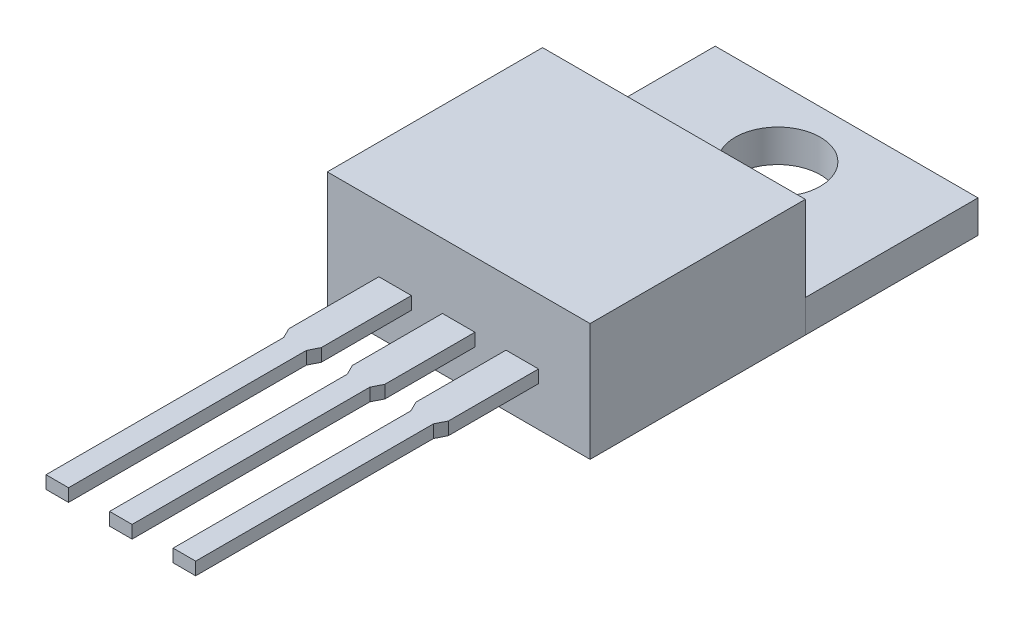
ISO-10303-21;
HEADER;
FILE_DESCRIPTION(('STEP AP214'),'2;1');
FILE_NAME('part.step','',(''),(''),'','','');
FILE_SCHEMA(('AUTOMOTIVE_DESIGN { 1 0 10303 214 1 1 1 1 }'));
ENDSEC;
DATA;
#1=APPLICATION_CONTEXT('core data for automotive mechanical design processes');
#2=APPLICATION_PROTOCOL_DEFINITION('international standard','automotive_design',2000,#1);
#3=PRODUCT_CONTEXT('',#1,'mechanical');
#4=PRODUCT('Part','Part','',(#3));
#5=PRODUCT_RELATED_PRODUCT_CATEGORY('part','',(#4));
#6=PRODUCT_DEFINITION_FORMATION('','',#4);
#7=PRODUCT_DEFINITION_CONTEXT('part definition',#1,'design');
#8=PRODUCT_DEFINITION('design','',#6,#7);
#9=PRODUCT_DEFINITION_SHAPE('','',#8);
#10=(LENGTH_UNIT() NAMED_UNIT(*) SI_UNIT(.MILLI.,.METRE.));
#11=(NAMED_UNIT(*) PLANE_ANGLE_UNIT() SI_UNIT($,.RADIAN.));
#12=(NAMED_UNIT(*) SI_UNIT($,.STERADIAN.) SOLID_ANGLE_UNIT());
#13=UNCERTAINTY_MEASURE_WITH_UNIT(LENGTH_MEASURE(1.E-05),#10,'distance_accuracy_value','');
#14=(GEOMETRIC_REPRESENTATION_CONTEXT(3) GLOBAL_UNCERTAINTY_ASSIGNED_CONTEXT((#13)) GLOBAL_UNIT_ASSIGNED_CONTEXT((#10,
#11,#12)) REPRESENTATION_CONTEXT('',''));
#15=CARTESIAN_POINT('',(0.,0.,0.));
#16=DIRECTION('',(0.,0.,1.));
#17=DIRECTION('',(1.,0.,0.));
#18=AXIS2_PLACEMENT_3D('',#15,#16,#17);
#19=CARTESIAN_POINT('',(-5.25,0.,-2.75));
#20=DIRECTION('',(0.,-1.,0.));
#21=DIRECTION('',(0.,0.,-1.));
#22=AXIS2_PLACEMENT_3D('',#19,#20,#21);
#23=PLANE('',#22);
#24=DIRECTION('',(0.,0.,1.));
#25=VECTOR('',#24,1.);
#26=CARTESIAN_POINT('',(-5.25,0.,12.75));
#27=LINE('',#26,#25);
#28=CARTESIAN_POINT('',(-5.25,0.,4.15));
#29=VERTEX_POINT('',#28);
#30=CARTESIAN_POINT('',(-5.25,0.,12.75));
#31=VERTEX_POINT('',#30);
#32=EDGE_CURVE('E540',#29,#31,#27,.T.);
#33=ORIENTED_EDGE('',*,*,#32,.F.);
#34=DIRECTION('',(1.,0.,0.));
#35=VECTOR('',#34,1.);
#36=CARTESIAN_POINT('',(-5.25,0.,4.15));
#37=LINE('',#36,#35);
#38=CARTESIAN_POINT('',(-4.25000000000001,0.,4.15));
#39=VERTEX_POINT('',#38);
#40=EDGE_CURVE('E12',#29,#39,#37,.T.);
#41=ORIENTED_EDGE('',*,*,#40,.T.);
#42=DIRECTION('',(0.,0.,1.));
#43=VECTOR('',#42,1.);
#44=CARTESIAN_POINT('',(-4.25000000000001,0.,-2.75));
#45=LINE('',#44,#43);
#46=CARTESIAN_POINT('',(-4.25,0.,11.75));
#47=VERTEX_POINT('',#46);
#48=EDGE_CURVE('E51',#39,#47,#45,.T.);
#49=ORIENTED_EDGE('',*,*,#48,.T.);
#50=DIRECTION('',(1.,0.,0.));
#51=VECTOR('',#50,1.);
#52=CARTESIAN_POINT('',(-5.25,0.,11.75));
#53=LINE('',#52,#51);
#54=CARTESIAN_POINT('',(4.25,0.,11.75));
#55=VERTEX_POINT('',#54);
#56=EDGE_CURVE('E592',#47,#55,#53,.T.);
#57=ORIENTED_EDGE('',*,*,#56,.T.);
#58=DIRECTION('',(0.,0.,-1.));
#59=VECTOR('',#58,1.);
#60=CARTESIAN_POINT('',(4.25000000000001,0.,-2.75));
#61=LINE('',#60,#59);
#62=CARTESIAN_POINT('',(4.25000000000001,0.,4.15));
#63=VERTEX_POINT('',#62);
#64=EDGE_CURVE('E589',#55,#63,#61,.T.);
#65=ORIENTED_EDGE('',*,*,#64,.T.);
#66=DIRECTION('',(1.,0.,0.));
#67=VECTOR('',#66,1.);
#68=CARTESIAN_POINT('',(-5.25,0.,4.15));
#69=LINE('',#68,#67);
#70=CARTESIAN_POINT('',(5.25,0.,4.15));
#71=VERTEX_POINT('',#70);
#72=EDGE_CURVE('E45',#63,#71,#69,.T.);
#73=ORIENTED_EDGE('',*,*,#72,.T.);
#74=DIRECTION('',(0.,0.,-1.));
#75=VECTOR('',#74,1.);
#76=CARTESIAN_POINT('',(5.25,0.,12.75));
#77=LINE('',#76,#75);
#78=CARTESIAN_POINT('',(5.25,0.,12.75));
#79=VERTEX_POINT('',#78);
#80=EDGE_CURVE('E561',#79,#71,#77,.T.);
#81=ORIENTED_EDGE('',*,*,#80,.F.);
#82=DIRECTION('',(1.,0.,0.));
#83=VECTOR('',#82,1.);
#84=CARTESIAN_POINT('',(-5.25,0.,12.75));
#85=LINE('',#84,#83);
#86=EDGE_CURVE('E557',#31,#79,#85,.T.);
#87=ORIENTED_EDGE('',*,*,#86,.F.);
#88=EDGE_LOOP('',(#33,#41,#49,#57,#65,#73,#81,#87));
#89=FACE_BOUND('',#88,.T.);
#90=ADVANCED_FACE('F41',(#89),#23,.T.);
#91=CARTESIAN_POINT('',(5.25,4.7,12.75));
#92=DIRECTION('',(-1.,0.,0.));
#93=DIRECTION('',(0.,0.,1.));
#94=AXIS2_PLACEMENT_3D('',#91,#92,#93);
#95=PLANE('',#94);
#96=DIRECTION('',(0.,-1.,0.));
#97=VECTOR('',#96,1.);
#98=CARTESIAN_POINT('',(5.25,4.7,4.15));
#99=LINE('',#98,#97);
#100=CARTESIAN_POINT('',(5.25000000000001,1.3,4.15));
#101=VERTEX_POINT('',#100);
#102=EDGE_CURVE('E585',#101,#71,#99,.T.);
#103=ORIENTED_EDGE('',*,*,#102,.F.);
#104=DIRECTION('',(0.,1.,0.));
#105=VECTOR('',#104,1.);
#106=CARTESIAN_POINT('',(5.25000000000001,-12.5642349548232,4.15));
#107=LINE('',#106,#105);
#108=CARTESIAN_POINT('',(5.25000000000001,4.7,4.15));
#109=VERTEX_POINT('',#108);
#110=EDGE_CURVE('E523',#101,#109,#107,.T.);
#111=ORIENTED_EDGE('',*,*,#110,.T.);
#112=DIRECTION('',(0.,0.,-1.));
#113=VECTOR('',#112,1.);
#114=CARTESIAN_POINT('',(5.25,4.7,12.75));
#115=LINE('',#114,#113);
#116=CARTESIAN_POINT('',(5.25,4.7,12.75));
#117=VERTEX_POINT('',#116);
#118=EDGE_CURVE('E548',#117,#109,#115,.T.);
#119=ORIENTED_EDGE('',*,*,#118,.F.);
#120=DIRECTION('',(0.,-1.,0.));
#121=VECTOR('',#120,1.);
#122=CARTESIAN_POINT('',(5.25,4.7,12.75));
#123=LINE('',#122,#121);
#124=EDGE_CURVE('E574',#117,#79,#123,.T.);
#125=ORIENTED_EDGE('',*,*,#124,.T.);
#126=ORIENTED_EDGE('',*,*,#80,.T.);
#127=EDGE_LOOP('',(#103,#111,#119,#125,#126));
#128=FACE_BOUND('',#127,.T.);
#129=ADVANCED_FACE('F662',(#128),#95,.F.);
#130=CARTESIAN_POINT('',(-5.25,4.7,12.75));
#131=DIRECTION('',(1.,0.,0.));
#132=DIRECTION('',(0.,0.,-1.));
#133=AXIS2_PLACEMENT_3D('',#130,#131,#132);
#134=PLANE('',#133);
#135=DIRECTION('',(0.,1.,0.));
#136=VECTOR('',#135,1.);
#137=CARTESIAN_POINT('',(-5.25,4.7,4.15));
#138=LINE('',#137,#136);
#139=CARTESIAN_POINT('',(-5.25,1.3,4.15));
#140=VERTEX_POINT('',#139);
#141=EDGE_CURVE('E582',#29,#140,#138,.T.);
#142=ORIENTED_EDGE('',*,*,#141,.F.);
#143=ORIENTED_EDGE('',*,*,#32,.T.);
#144=DIRECTION('',(0.,-1.,0.));
#145=VECTOR('',#144,1.);
#146=CARTESIAN_POINT('',(-5.25,4.7,12.75));
#147=LINE('',#146,#145);
#148=CARTESIAN_POINT('',(-5.25,4.7,12.75));
#149=VERTEX_POINT('',#148);
#150=EDGE_CURVE('E578',#149,#31,#147,.T.);
#151=ORIENTED_EDGE('',*,*,#150,.F.);
#152=DIRECTION('',(0.,0.,1.));
#153=VECTOR('',#152,1.);
#154=CARTESIAN_POINT('',(-5.25,4.7,12.75));
#155=LINE('',#154,#153);
#156=CARTESIAN_POINT('',(-5.25,4.7,4.15));
#157=VERTEX_POINT('',#156);
#158=EDGE_CURVE('E541',#157,#149,#155,.T.);
#159=ORIENTED_EDGE('',*,*,#158,.F.);
#160=DIRECTION('',(0.,1.,0.));
#161=VECTOR('',#160,1.);
#162=CARTESIAN_POINT('',(-5.25,-12.5642349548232,4.15));
#163=LINE('',#162,#161);
#164=EDGE_CURVE('E528',#140,#157,#163,.T.);
#165=ORIENTED_EDGE('',*,*,#164,.F.);
#166=EDGE_LOOP('',(#142,#143,#151,#159,#165));
#167=FACE_BOUND('',#166,.T.);
#168=ADVANCED_FACE('F653',(#167),#134,.F.);
#169=CARTESIAN_POINT('',(-5.25,4.7,12.75));
#170=DIRECTION('',(0.,0.,-1.));
#171=DIRECTION('',(-1.,0.,0.));
#172=AXIS2_PLACEMENT_3D('',#169,#170,#171);
#173=PLANE('',#172);
#174=DIRECTION('',(-1.,0.,0.));
#175=VECTOR('',#174,1.);
#176=CARTESIAN_POINT('',(-3.19,2.1,12.75));
#177=LINE('',#176,#175);
#178=CARTESIAN_POINT('',(-1.89,2.1,12.75));
#179=VERTEX_POINT('',#178);
#180=CARTESIAN_POINT('',(-3.19,2.1,12.75));
#181=VERTEX_POINT('',#180);
#182=EDGE_CURVE('E401',#179,#181,#177,.T.);
#183=ORIENTED_EDGE('',*,*,#182,.F.);
#184=DIRECTION('',(0.,-1.,0.));
#185=VECTOR('',#184,1.);
#186=CARTESIAN_POINT('',(-1.89,2.1,12.75));
#187=LINE('',#186,#185);
#188=CARTESIAN_POINT('',(-1.89,1.59,12.75));
#189=VERTEX_POINT('',#188);
#190=EDGE_CURVE('E418',#179,#189,#187,.T.);
#191=ORIENTED_EDGE('',*,*,#190,.T.);
#192=DIRECTION('',(-1.,0.,0.));
#193=VECTOR('',#192,1.);
#194=CARTESIAN_POINT('',(-3.19,1.59,12.75));
#195=LINE('',#194,#193);
#196=CARTESIAN_POINT('',(-3.19,1.59,12.75));
#197=VERTEX_POINT('',#196);
#198=EDGE_CURVE('E400',#189,#197,#195,.T.);
#199=ORIENTED_EDGE('',*,*,#198,.T.);
#200=DIRECTION('',(0.,-1.,0.));
#201=VECTOR('',#200,1.);
#202=CARTESIAN_POINT('',(-3.19,2.1,12.75));
#203=LINE('',#202,#201);
#204=EDGE_CURVE('E451',#181,#197,#203,.T.);
#205=ORIENTED_EDGE('',*,*,#204,.F.);
#206=EDGE_LOOP('',(#183,#191,#199,#205));
#207=FACE_BOUND('',#206,.T.);
#208=ORIENTED_EDGE('',*,*,#86,.T.);
#209=ORIENTED_EDGE('',*,*,#124,.F.);
#210=DIRECTION('',(1.,0.,0.));
#211=VECTOR('',#210,1.);
#212=CARTESIAN_POINT('',(-5.25,4.7,12.75));
#213=LINE('',#212,#211);
#214=EDGE_CURVE('E544',#149,#117,#213,.T.);
#215=ORIENTED_EDGE('',*,*,#214,.F.);
#216=ORIENTED_EDGE('',*,*,#150,.T.);
#217=EDGE_LOOP('',(#208,#209,#215,#216));
#218=FACE_BOUND('',#217,.T.);
#219=DIRECTION('',(-1.,0.,0.));
#220=VECTOR('',#219,1.);
#221=CARTESIAN_POINT('',(-0.65,2.1,12.75));
#222=LINE('',#221,#220);
#223=CARTESIAN_POINT('',(0.65,2.1,12.75));
#224=VERTEX_POINT('',#223);
#225=CARTESIAN_POINT('',(-0.65,2.1,12.75));
#226=VERTEX_POINT('',#225);
#227=EDGE_CURVE('E455',#224,#226,#222,.T.);
#228=ORIENTED_EDGE('',*,*,#227,.F.);
#229=DIRECTION('',(0.,-1.,0.));
#230=VECTOR('',#229,1.);
#231=CARTESIAN_POINT('',(0.65,2.1,12.75));
#232=LINE('',#231,#230);
#233=CARTESIAN_POINT('',(0.65,1.59,12.75));
#234=VERTEX_POINT('',#233);
#235=EDGE_CURVE('E472',#224,#234,#232,.T.);
#236=ORIENTED_EDGE('',*,*,#235,.T.);
#237=DIRECTION('',(-1.,0.,0.));
#238=VECTOR('',#237,1.);
#239=CARTESIAN_POINT('',(-0.65,1.59,12.75));
#240=LINE('',#239,#238);
#241=CARTESIAN_POINT('',(-0.65,1.59,12.75));
#242=VERTEX_POINT('',#241);
#243=EDGE_CURVE('E454',#234,#242,#240,.T.);
#244=ORIENTED_EDGE('',*,*,#243,.T.);
#245=DIRECTION('',(0.,-1.,0.));
#246=VECTOR('',#245,1.);
#247=CARTESIAN_POINT('',(-0.65,2.1,12.75));
#248=LINE('',#247,#246);
#249=EDGE_CURVE('E505',#226,#242,#248,.T.);
#250=ORIENTED_EDGE('',*,*,#249,.F.);
#251=EDGE_LOOP('',(#228,#236,#244,#250));
#252=FACE_BOUND('',#251,.T.);
#253=DIRECTION('',(-1.,0.,0.));
#254=VECTOR('',#253,1.);
#255=CARTESIAN_POINT('',(1.89,2.1,12.75));
#256=LINE('',#255,#254);
#257=CARTESIAN_POINT('',(3.19,2.1,12.75));
#258=VERTEX_POINT('',#257);
#259=CARTESIAN_POINT('',(1.89,2.1,12.75));
#260=VERTEX_POINT('',#259);
#261=EDGE_CURVE('E355',#258,#260,#256,.T.);
#262=ORIENTED_EDGE('',*,*,#261,.F.);
#263=DIRECTION('',(0.,-1.,0.));
#264=VECTOR('',#263,1.);
#265=CARTESIAN_POINT('',(3.19,2.1,12.75));
#266=LINE('',#265,#264);
#267=CARTESIAN_POINT('',(3.19,1.59,12.75));
#268=VERTEX_POINT('',#267);
#269=EDGE_CURVE('E392',#258,#268,#266,.T.);
#270=ORIENTED_EDGE('',*,*,#269,.T.);
#271=DIRECTION('',(-1.,0.,0.));
#272=VECTOR('',#271,1.);
#273=CARTESIAN_POINT('',(1.89,1.59,12.75));
#274=LINE('',#273,#272);
#275=CARTESIAN_POINT('',(1.89,1.59,12.75));
#276=VERTEX_POINT('',#275);
#277=EDGE_CURVE('E371',#268,#276,#274,.T.);
#278=ORIENTED_EDGE('',*,*,#277,.T.);
#279=DIRECTION('',(0.,-1.,0.));
#280=VECTOR('',#279,1.);
#281=CARTESIAN_POINT('',(1.89,2.1,12.75));
#282=LINE('',#281,#280);
#283=EDGE_CURVE('E388',#260,#276,#282,.T.);
#284=ORIENTED_EDGE('',*,*,#283,.F.);
#285=EDGE_LOOP('',(#262,#270,#278,#284));
#286=FACE_BOUND('',#285,.T.);
#287=ADVANCED_FACE('F650',(#207,#218,#252,#286),#173,.F.);
#288=ORIENTED_EDGE('',*,*,#40,.F.);
#289=CARTESIAN_POINT('',(-5.25,0.,-2.75));
#290=VERTEX_POINT('',#289);
#291=EDGE_CURVE('E553',#290,#29,#27,.T.);
#292=ORIENTED_EDGE('',*,*,#291,.F.);
#293=DIRECTION('',(-1.,0.,0.));
#294=VECTOR('',#293,1.);
#295=CARTESIAN_POINT('',(-5.25,0.,-2.75));
#296=LINE('',#295,#294);
#297=CARTESIAN_POINT('',(5.25,0.,-2.75));
#298=VERTEX_POINT('',#297);
#299=EDGE_CURVE('E545',#298,#290,#296,.T.);
#300=ORIENTED_EDGE('',*,*,#299,.F.);
#301=EDGE_CURVE('E560',#71,#298,#77,.T.);
#302=ORIENTED_EDGE('',*,*,#301,.F.);
#303=ORIENTED_EDGE('',*,*,#72,.F.);
#304=ORIENTED_EDGE('',*,*,#64,.F.);
#305=ORIENTED_EDGE('',*,*,#56,.F.);
#306=ORIENTED_EDGE('',*,*,#48,.F.);
#307=EDGE_LOOP('',(#288,#292,#300,#302,#303,#304,#305,#306));
#308=FACE_BOUND('',#307,.T.);
#309=CARTESIAN_POINT('',(0.,0.,0.));
#310=DIRECTION('',(0.,1.,0.));
#311=DIRECTION('',(0.,0.,1.));
#312=AXIS2_PLACEMENT_3D('',#309,#310,#311);
#313=CIRCLE('',#312,1.7);
#314=CARTESIAN_POINT('',(0.,0.,1.7));
#315=VERTEX_POINT('',#314);
#316=EDGE_CURVE('E508',#315,#315,#313,.T.);
#317=ORIENTED_EDGE('',*,*,#316,.T.);
#318=EDGE_LOOP('',(#317));
#319=FACE_BOUND('',#318,.T.);
#320=ADVANCED_FACE('F652',(#308,#319),#23,.T.);
#321=CARTESIAN_POINT('',(-5.25,1.3,-2.75));
#322=DIRECTION('',(0.,-1.,0.));
#323=DIRECTION('',(0.,0.,-1.));
#324=AXIS2_PLACEMENT_3D('',#321,#322,#323);
#325=PLANE('',#324);
#326=DIRECTION('',(0.,0.,1.));
#327=VECTOR('',#326,1.);
#328=CARTESIAN_POINT('',(-5.25,1.3,-2.75));
#329=LINE('',#328,#327);
#330=CARTESIAN_POINT('',(-5.25,1.3,-2.75));
#331=VERTEX_POINT('',#330);
#332=EDGE_CURVE('E524',#331,#140,#329,.T.);
#333=ORIENTED_EDGE('',*,*,#332,.T.);
#334=DIRECTION('',(1.,0.,0.));
#335=VECTOR('',#334,1.);
#336=CARTESIAN_POINT('',(-5.25,1.3,4.15));
#337=LINE('',#336,#335);
#338=EDGE_CURVE('E519',#140,#101,#337,.T.);
#339=ORIENTED_EDGE('',*,*,#338,.T.);
#340=DIRECTION('',(0.,0.,-1.));
#341=VECTOR('',#340,1.);
#342=CARTESIAN_POINT('',(5.25,1.3,-2.75));
#343=LINE('',#342,#341);
#344=CARTESIAN_POINT('',(5.25,1.3,-2.75));
#345=VERTEX_POINT('',#344);
#346=EDGE_CURVE('E532',#101,#345,#343,.T.);
#347=ORIENTED_EDGE('',*,*,#346,.T.);
#348=DIRECTION('',(-1.,0.,0.));
#349=VECTOR('',#348,1.);
#350=CARTESIAN_POINT('',(-5.25,1.3,-2.75));
#351=LINE('',#350,#349);
#352=EDGE_CURVE('E529',#345,#331,#351,.T.);
#353=ORIENTED_EDGE('',*,*,#352,.T.);
#354=EDGE_LOOP('',(#333,#339,#347,#353));
#355=FACE_BOUND('',#354,.T.);
#356=CARTESIAN_POINT('',(0.,1.3,0.));
#357=DIRECTION('',(0.,1.,0.));
#358=DIRECTION('',(0.,0.,1.));
#359=AXIS2_PLACEMENT_3D('',#356,#357,#358);
#360=CIRCLE('',#359,1.7);
#361=CARTESIAN_POINT('',(0.,1.3,1.7));
#362=VERTEX_POINT('',#361);
#363=EDGE_CURVE('E512',#362,#362,#360,.T.);
#364=ORIENTED_EDGE('',*,*,#363,.F.);
#365=EDGE_LOOP('',(#364));
#366=FACE_BOUND('',#365,.T.);
#367=ADVANCED_FACE('F659',(#355,#366),#325,.F.);
#368=ORIENTED_EDGE('',*,*,#291,.T.);
#369=ORIENTED_EDGE('',*,*,#141,.T.);
#370=ORIENTED_EDGE('',*,*,#332,.F.);
#371=DIRECTION('',(0.,-1.,0.));
#372=VECTOR('',#371,1.);
#373=CARTESIAN_POINT('',(-5.25,4.7,-2.75));
#374=LINE('',#373,#372);
#375=EDGE_CURVE('E552',#331,#290,#374,.T.);
#376=ORIENTED_EDGE('',*,*,#375,.T.);
#377=EDGE_LOOP('',(#368,#369,#370,#376));
#378=FACE_BOUND('',#377,.T.);
#379=ADVANCED_FACE('F43',(#378),#134,.F.);
#380=ORIENTED_EDGE('',*,*,#346,.F.);
#381=ORIENTED_EDGE('',*,*,#102,.T.);
#382=ORIENTED_EDGE('',*,*,#301,.T.);
#383=DIRECTION('',(0.,-1.,0.));
#384=VECTOR('',#383,1.);
#385=CARTESIAN_POINT('',(5.25,4.7,-2.75));
#386=LINE('',#385,#384);
#387=EDGE_CURVE('E570',#345,#298,#386,.T.);
#388=ORIENTED_EDGE('',*,*,#387,.F.);
#389=EDGE_LOOP('',(#380,#381,#382,#388));
#390=FACE_BOUND('',#389,.T.);
#391=ADVANCED_FACE('F672',(#390),#95,.F.);
#392=CARTESIAN_POINT('',(-5.25,4.7,-2.75));
#393=DIRECTION('',(0.,0.,1.));
#394=DIRECTION('',(1.,0.,0.));
#395=AXIS2_PLACEMENT_3D('',#392,#393,#394);
#396=PLANE('',#395);
#397=ORIENTED_EDGE('',*,*,#375,.F.);
#398=ORIENTED_EDGE('',*,*,#352,.F.);
#399=ORIENTED_EDGE('',*,*,#387,.T.);
#400=ORIENTED_EDGE('',*,*,#299,.T.);
#401=EDGE_LOOP('',(#397,#398,#399,#400));
#402=FACE_BOUND('',#401,.T.);
#403=ADVANCED_FACE('F677',(#402),#396,.F.);
#404=CARTESIAN_POINT('',(-5.25,4.7,-2.75));
#405=DIRECTION('',(0.,-1.,0.));
#406=DIRECTION('',(0.,0.,-1.));
#407=AXIS2_PLACEMENT_3D('',#404,#405,#406);
#408=PLANE('',#407);
#409=ORIENTED_EDGE('',*,*,#118,.T.);
#410=DIRECTION('',(1.,0.,0.));
#411=VECTOR('',#410,1.);
#412=CARTESIAN_POINT('',(-5.25,4.7,4.15));
#413=LINE('',#412,#411);
#414=EDGE_CURVE('E516',#157,#109,#413,.T.);
#415=ORIENTED_EDGE('',*,*,#414,.F.);
#416=ORIENTED_EDGE('',*,*,#158,.T.);
#417=ORIENTED_EDGE('',*,*,#214,.T.);
#418=EDGE_LOOP('',(#409,#415,#416,#417));
#419=FACE_BOUND('',#418,.T.);
#420=ADVANCED_FACE('F675',(#419),#408,.F.);
#421=CARTESIAN_POINT('',(-5.25,-12.5642349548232,4.15));
#422=DIRECTION('',(0.,0.,1.));
#423=DIRECTION('',(1.,0.,0.));
#424=AXIS2_PLACEMENT_3D('',#421,#422,#423);
#425=PLANE('',#424);
#426=ORIENTED_EDGE('',*,*,#164,.T.);
#427=ORIENTED_EDGE('',*,*,#414,.T.);
#428=ORIENTED_EDGE('',*,*,#110,.F.);
#429=ORIENTED_EDGE('',*,*,#338,.F.);
#430=EDGE_LOOP('',(#426,#427,#428,#429));
#431=FACE_BOUND('',#430,.T.);
#432=ADVANCED_FACE('F703',(#431),#425,.F.);
#433=CARTESIAN_POINT('',(0.,1.3,0.));
#434=DIRECTION('',(0.,1.,0.));
#435=DIRECTION('',(0.,0.,1.));
#436=AXIS2_PLACEMENT_3D('',#433,#434,#435);
#437=CYLINDRICAL_SURFACE('',#436,1.7);
#438=ORIENTED_EDGE('',*,*,#316,.F.);
#439=EDGE_LOOP('',(#438));
#440=FACE_BOUND('',#439,.T.);
#441=ORIENTED_EDGE('',*,*,#363,.T.);
#442=EDGE_LOOP('',(#441));
#443=FACE_BOUND('',#442,.T.);
#444=ADVANCED_FACE('F716',(#440,#443),#437,.F.);
#445=CARTESIAN_POINT('',(-0.65,2.1,12.75));
#446=DIRECTION('',(1.,0.,0.));
#447=DIRECTION('',(0.,0.,-1.));
#448=AXIS2_PLACEMENT_3D('',#445,#446,#447);
#449=PLANE('',#448);
#450=DIRECTION('',(0.,0.,1.));
#451=VECTOR('',#450,1.);
#452=CARTESIAN_POINT('',(-0.65,1.59,12.75));
#453=LINE('',#452,#451);
#454=CARTESIAN_POINT('',(-0.65,1.59,16.35));
#455=VERTEX_POINT('',#454);
#456=EDGE_CURVE('E476',#242,#455,#453,.T.);
#457=ORIENTED_EDGE('',*,*,#456,.T.);
#458=DIRECTION('',(0.,-1.,0.));
#459=VECTOR('',#458,1.);
#460=CARTESIAN_POINT('',(-0.65,2.1,16.35));
#461=LINE('',#460,#459);
#462=CARTESIAN_POINT('',(-0.65,2.1,16.35));
#463=VERTEX_POINT('',#462);
#464=EDGE_CURVE('E501',#463,#455,#461,.T.);
#465=ORIENTED_EDGE('',*,*,#464,.F.);
#466=DIRECTION('',(0.,0.,1.));
#467=VECTOR('',#466,1.);
#468=CARTESIAN_POINT('',(-0.65,2.1,12.75));
#469=LINE('',#468,#467);
#470=EDGE_CURVE('E459',#226,#463,#469,.T.);
#471=ORIENTED_EDGE('',*,*,#470,.F.);
#472=ORIENTED_EDGE('',*,*,#249,.T.);
#473=EDGE_LOOP('',(#457,#465,#471,#472));
#474=FACE_BOUND('',#473,.T.);
#475=ADVANCED_FACE('F719',(#474),#449,.F.);
#476=CARTESIAN_POINT('',(-0.65,2.1,16.35));
#477=DIRECTION('',(0.894427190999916,0.,-0.447213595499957));
#478=DIRECTION('',(-0.447213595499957,0.,-0.894427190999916));
#479=AXIS2_PLACEMENT_3D('',#476,#477,#478);
#480=PLANE('',#479);
#481=DIRECTION('',(0.447213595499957,0.,0.894427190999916));
#482=VECTOR('',#481,1.);
#483=CARTESIAN_POINT('',(-0.65,1.59,16.35));
#484=LINE('',#483,#482);
#485=CARTESIAN_POINT('',(-0.45,1.59,16.75));
#486=VERTEX_POINT('',#485);
#487=EDGE_CURVE('E479',#455,#486,#484,.T.);
#488=ORIENTED_EDGE('',*,*,#487,.T.);
#489=DIRECTION('',(0.,-1.,0.));
#490=VECTOR('',#489,1.);
#491=CARTESIAN_POINT('',(-0.45,2.1,16.75));
#492=LINE('',#491,#490);
#493=CARTESIAN_POINT('',(-0.45,2.1,16.75));
#494=VERTEX_POINT('',#493);
#495=EDGE_CURVE('E497',#494,#486,#492,.T.);
#496=ORIENTED_EDGE('',*,*,#495,.F.);
#497=DIRECTION('',(0.447213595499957,0.,0.894427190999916));
#498=VECTOR('',#497,1.);
#499=CARTESIAN_POINT('',(-0.65,2.1,16.35));
#500=LINE('',#499,#498);
#501=EDGE_CURVE('E463',#463,#494,#500,.T.);
#502=ORIENTED_EDGE('',*,*,#501,.F.);
#503=ORIENTED_EDGE('',*,*,#464,.T.);
#504=EDGE_LOOP('',(#488,#496,#502,#503));
#505=FACE_BOUND('',#504,.T.);
#506=ADVANCED_FACE('F730',(#505),#480,.F.);
#507=CARTESIAN_POINT('',(0.65,2.1,16.35));
#508=DIRECTION('',(-0.894427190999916,0.,-0.447213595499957));
#509=DIRECTION('',(-0.447213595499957,0.,0.894427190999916));
#510=AXIS2_PLACEMENT_3D('',#507,#508,#509);
#511=PLANE('',#510);
#512=DIRECTION('',(0.447213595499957,0.,-0.894427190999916));
#513=VECTOR('',#512,1.);
#514=CARTESIAN_POINT('',(0.65,1.59,16.35));
#515=LINE('',#514,#513);
#516=CARTESIAN_POINT('',(0.45,1.59,16.75));
#517=VERTEX_POINT('',#516);
#518=CARTESIAN_POINT('',(0.65,1.59,16.35));
#519=VERTEX_POINT('',#518);
#520=EDGE_CURVE('E482',#517,#519,#515,.T.);
#521=ORIENTED_EDGE('',*,*,#520,.T.);
#522=DIRECTION('',(0.,-1.,0.));
#523=VECTOR('',#522,1.);
#524=CARTESIAN_POINT('',(0.65,2.1,16.35));
#525=LINE('',#524,#523);
#526=CARTESIAN_POINT('',(0.65,2.1,16.35));
#527=VERTEX_POINT('',#526);
#528=EDGE_CURVE('E490',#527,#519,#525,.T.);
#529=ORIENTED_EDGE('',*,*,#528,.F.);
#530=DIRECTION('',(0.447213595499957,0.,-0.894427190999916));
#531=VECTOR('',#530,1.);
#532=CARTESIAN_POINT('',(0.65,2.1,16.35));
#533=LINE('',#532,#531);
#534=CARTESIAN_POINT('',(0.45,2.1,16.75));
#535=VERTEX_POINT('',#534);
#536=EDGE_CURVE('E466',#535,#527,#533,.T.);
#537=ORIENTED_EDGE('',*,*,#536,.F.);
#538=DIRECTION('',(0.,-1.,0.));
#539=VECTOR('',#538,1.);
#540=CARTESIAN_POINT('',(0.45,2.1,16.75));
#541=LINE('',#540,#539);
#542=EDGE_CURVE('E494',#535,#517,#541,.T.);
#543=ORIENTED_EDGE('',*,*,#542,.T.);
#544=EDGE_LOOP('',(#521,#529,#537,#543));
#545=FACE_BOUND('',#544,.T.);
#546=ADVANCED_FACE('F734',(#545),#511,.F.);
#547=CARTESIAN_POINT('',(0.65,2.1,12.75));
#548=DIRECTION('',(-1.,0.,0.));
#549=DIRECTION('',(0.,0.,1.));
#550=AXIS2_PLACEMENT_3D('',#547,#548,#549);
#551=PLANE('',#550);
#552=DIRECTION('',(0.,0.,-1.));
#553=VECTOR('',#552,1.);
#554=CARTESIAN_POINT('',(0.65,1.59,12.75));
#555=LINE('',#554,#553);
#556=EDGE_CURVE('E460',#519,#234,#555,.T.);
#557=ORIENTED_EDGE('',*,*,#556,.T.);
#558=ORIENTED_EDGE('',*,*,#235,.F.);
#559=DIRECTION('',(0.,0.,-1.));
#560=VECTOR('',#559,1.);
#561=CARTESIAN_POINT('',(0.65,2.1,12.75));
#562=LINE('',#561,#560);
#563=EDGE_CURVE('E469',#527,#224,#562,.T.);
#564=ORIENTED_EDGE('',*,*,#563,.F.);
#565=ORIENTED_EDGE('',*,*,#528,.T.);
#566=EDGE_LOOP('',(#557,#558,#564,#565));
#567=FACE_BOUND('',#566,.T.);
#568=ADVANCED_FACE('F738',(#567),#551,.F.);
#569=CARTESIAN_POINT('',(0.65,2.1,12.75));
#570=DIRECTION('',(0.,-1.,0.));
#571=DIRECTION('',(0.,0.,-1.));
#572=AXIS2_PLACEMENT_3D('',#569,#570,#571);
#573=PLANE('',#572);
#574=ORIENTED_EDGE('',*,*,#227,.T.);
#575=ORIENTED_EDGE('',*,*,#470,.T.);
#576=ORIENTED_EDGE('',*,*,#501,.T.);
#577=DIRECTION('',(0.,0.,-1.));
#578=VECTOR('',#577,1.);
#579=CARTESIAN_POINT('',(-0.45,2.1,26.25));
#580=LINE('',#579,#578);
#581=CARTESIAN_POINT('',(-0.45,2.1,26.25));
#582=VERTEX_POINT('',#581);
#583=EDGE_CURVE('E302',#582,#494,#580,.T.);
#584=ORIENTED_EDGE('',*,*,#583,.F.);
#585=DIRECTION('',(-1.,0.,0.));
#586=VECTOR('',#585,1.);
#587=CARTESIAN_POINT('',(-0.45,2.1,26.25));
#588=LINE('',#587,#586);
#589=CARTESIAN_POINT('',(0.45,2.1,26.25));
#590=VERTEX_POINT('',#589);
#591=EDGE_CURVE('E299',#590,#582,#588,.T.);
#592=ORIENTED_EDGE('',*,*,#591,.F.);
#593=DIRECTION('',(0.,0.,-1.));
#594=VECTOR('',#593,1.);
#595=CARTESIAN_POINT('',(0.45,2.1,26.25));
#596=LINE('',#595,#594);
#597=EDGE_CURVE('E306',#590,#535,#596,.T.);
#598=ORIENTED_EDGE('',*,*,#597,.T.);
#599=ORIENTED_EDGE('',*,*,#536,.T.);
#600=ORIENTED_EDGE('',*,*,#563,.T.);
#601=EDGE_LOOP('',(#574,#575,#576,#584,#592,#598,#599,#600));
#602=FACE_BOUND('',#601,.T.);
#603=ADVANCED_FACE('F742',(#602),#573,.F.);
#604=CARTESIAN_POINT('',(0.65,1.59,12.75));
#605=DIRECTION('',(0.,-1.,0.));
#606=DIRECTION('',(0.,0.,-1.));
#607=AXIS2_PLACEMENT_3D('',#604,#605,#606);
#608=PLANE('',#607);
#609=ORIENTED_EDGE('',*,*,#243,.F.);
#610=ORIENTED_EDGE('',*,*,#556,.F.);
#611=ORIENTED_EDGE('',*,*,#520,.F.);
#612=DIRECTION('',(0.,0.,-1.));
#613=VECTOR('',#612,1.);
#614=CARTESIAN_POINT('',(0.45,1.59,26.25));
#615=LINE('',#614,#613);
#616=CARTESIAN_POINT('',(0.45,1.59,26.25));
#617=VERTEX_POINT('',#616);
#618=EDGE_CURVE('E310',#617,#517,#615,.T.);
#619=ORIENTED_EDGE('',*,*,#618,.F.);
#620=DIRECTION('',(1.,0.,0.));
#621=VECTOR('',#620,1.);
#622=CARTESIAN_POINT('',(-0.45,1.59,26.25));
#623=LINE('',#622,#621);
#624=CARTESIAN_POINT('',(-0.45,1.59,26.25));
#625=VERTEX_POINT('',#624);
#626=EDGE_CURVE('E287',#625,#617,#623,.T.);
#627=ORIENTED_EDGE('',*,*,#626,.F.);
#628=DIRECTION('',(0.,0.,-1.));
#629=VECTOR('',#628,1.);
#630=CARTESIAN_POINT('',(-0.45,1.59,26.25));
#631=LINE('',#630,#629);
#632=EDGE_CURVE('E314',#625,#486,#631,.T.);
#633=ORIENTED_EDGE('',*,*,#632,.T.);
#634=ORIENTED_EDGE('',*,*,#487,.F.);
#635=ORIENTED_EDGE('',*,*,#456,.F.);
#636=EDGE_LOOP('',(#609,#610,#611,#619,#627,#633,#634,#635));
#637=FACE_BOUND('',#636,.T.);
#638=ADVANCED_FACE('F744',(#637),#608,.T.);
#639=CARTESIAN_POINT('',(-3.19,2.1,12.75));
#640=DIRECTION('',(1.,0.,0.));
#641=DIRECTION('',(0.,0.,-1.));
#642=AXIS2_PLACEMENT_3D('',#639,#640,#641);
#643=PLANE('',#642);
#644=DIRECTION('',(0.,0.,1.));
#645=VECTOR('',#644,1.);
#646=CARTESIAN_POINT('',(-3.19,1.59,12.75));
#647=LINE('',#646,#645);
#648=CARTESIAN_POINT('',(-3.19,1.59,16.35));
#649=VERTEX_POINT('',#648);
#650=EDGE_CURVE('E422',#197,#649,#647,.T.);
#651=ORIENTED_EDGE('',*,*,#650,.T.);
#652=DIRECTION('',(0.,-1.,0.));
#653=VECTOR('',#652,1.);
#654=CARTESIAN_POINT('',(-3.19,2.1,16.35));
#655=LINE('',#654,#653);
#656=CARTESIAN_POINT('',(-3.19,2.1,16.35));
#657=VERTEX_POINT('',#656);
#658=EDGE_CURVE('E447',#657,#649,#655,.T.);
#659=ORIENTED_EDGE('',*,*,#658,.F.);
#660=DIRECTION('',(0.,0.,1.));
#661=VECTOR('',#660,1.);
#662=CARTESIAN_POINT('',(-3.19,2.1,12.75));
#663=LINE('',#662,#661);
#664=EDGE_CURVE('E405',#181,#657,#663,.T.);
#665=ORIENTED_EDGE('',*,*,#664,.F.);
#666=ORIENTED_EDGE('',*,*,#204,.T.);
#667=EDGE_LOOP('',(#651,#659,#665,#666));
#668=FACE_BOUND('',#667,.T.);
#669=ADVANCED_FACE('F747',(#668),#643,.F.);
#670=CARTESIAN_POINT('',(-3.19,2.1,16.35));
#671=DIRECTION('',(0.894427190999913,0.,-0.447213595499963));
#672=DIRECTION('',(-0.447213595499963,0.,-0.894427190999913));
#673=AXIS2_PLACEMENT_3D('',#670,#671,#672);
#674=PLANE('',#673);
#675=DIRECTION('',(0.447213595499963,0.,0.894427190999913));
#676=VECTOR('',#675,1.);
#677=CARTESIAN_POINT('',(-3.19,1.59,16.35));
#678=LINE('',#677,#676);
#679=CARTESIAN_POINT('',(-2.99,1.59,16.75));
#680=VERTEX_POINT('',#679);
#681=EDGE_CURVE('E425',#649,#680,#678,.T.);
#682=ORIENTED_EDGE('',*,*,#681,.T.);
#683=DIRECTION('',(0.,-1.,0.));
#684=VECTOR('',#683,1.);
#685=CARTESIAN_POINT('',(-2.99,2.1,16.75));
#686=LINE('',#685,#684);
#687=CARTESIAN_POINT('',(-2.99,2.1,16.75));
#688=VERTEX_POINT('',#687);
#689=EDGE_CURVE('E443',#688,#680,#686,.T.);
#690=ORIENTED_EDGE('',*,*,#689,.F.);
#691=DIRECTION('',(0.447213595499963,0.,0.894427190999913));
#692=VECTOR('',#691,1.);
#693=CARTESIAN_POINT('',(-3.19,2.1,16.35));
#694=LINE('',#693,#692);
#695=EDGE_CURVE('E409',#657,#688,#694,.T.);
#696=ORIENTED_EDGE('',*,*,#695,.F.);
#697=ORIENTED_EDGE('',*,*,#658,.T.);
#698=EDGE_LOOP('',(#682,#690,#696,#697));
#699=FACE_BOUND('',#698,.T.);
#700=ADVANCED_FACE('F754',(#699),#674,.F.);
#701=CARTESIAN_POINT('',(-1.89,2.1,16.35));
#702=DIRECTION('',(-0.894427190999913,0.,-0.447213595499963));
#703=DIRECTION('',(-0.447213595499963,0.,0.894427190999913));
#704=AXIS2_PLACEMENT_3D('',#701,#702,#703);
#705=PLANE('',#704);
#706=DIRECTION('',(0.447213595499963,0.,-0.894427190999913));
#707=VECTOR('',#706,1.);
#708=CARTESIAN_POINT('',(-1.89,1.59,16.35));
#709=LINE('',#708,#707);
#710=CARTESIAN_POINT('',(-2.09,1.59,16.75));
#711=VERTEX_POINT('',#710);
#712=CARTESIAN_POINT('',(-1.89,1.59,16.35));
#713=VERTEX_POINT('',#712);
#714=EDGE_CURVE('E428',#711,#713,#709,.T.);
#715=ORIENTED_EDGE('',*,*,#714,.T.);
#716=DIRECTION('',(0.,-1.,0.));
#717=VECTOR('',#716,1.);
#718=CARTESIAN_POINT('',(-1.89,2.1,16.35));
#719=LINE('',#718,#717);
#720=CARTESIAN_POINT('',(-1.89,2.1,16.35));
#721=VERTEX_POINT('',#720);
#722=EDGE_CURVE('E436',#721,#713,#719,.T.);
#723=ORIENTED_EDGE('',*,*,#722,.F.);
#724=DIRECTION('',(0.447213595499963,0.,-0.894427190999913));
#725=VECTOR('',#724,1.);
#726=CARTESIAN_POINT('',(-1.89,2.1,16.35));
#727=LINE('',#726,#725);
#728=CARTESIAN_POINT('',(-2.09,2.1,16.75));
#729=VERTEX_POINT('',#728);
#730=EDGE_CURVE('E412',#729,#721,#727,.T.);
#731=ORIENTED_EDGE('',*,*,#730,.F.);
#732=DIRECTION('',(0.,-1.,0.));
#733=VECTOR('',#732,1.);
#734=CARTESIAN_POINT('',(-2.09,2.1,16.75));
#735=LINE('',#734,#733);
#736=EDGE_CURVE('E440',#729,#711,#735,.T.);
#737=ORIENTED_EDGE('',*,*,#736,.T.);
#738=EDGE_LOOP('',(#715,#723,#731,#737));
#739=FACE_BOUND('',#738,.T.);
#740=ADVANCED_FACE('F758',(#739),#705,.F.);
#741=CARTESIAN_POINT('',(-1.89,2.1,12.75));
#742=DIRECTION('',(-1.,0.,0.));
#743=DIRECTION('',(0.,0.,1.));
#744=AXIS2_PLACEMENT_3D('',#741,#742,#743);
#745=PLANE('',#744);
#746=DIRECTION('',(0.,0.,-1.));
#747=VECTOR('',#746,1.);
#748=CARTESIAN_POINT('',(-1.89,1.59,12.75));
#749=LINE('',#748,#747);
#750=EDGE_CURVE('E406',#713,#189,#749,.T.);
#751=ORIENTED_EDGE('',*,*,#750,.T.);
#752=ORIENTED_EDGE('',*,*,#190,.F.);
#753=DIRECTION('',(0.,0.,-1.));
#754=VECTOR('',#753,1.);
#755=CARTESIAN_POINT('',(-1.89,2.1,12.75));
#756=LINE('',#755,#754);
#757=EDGE_CURVE('E415',#721,#179,#756,.T.);
#758=ORIENTED_EDGE('',*,*,#757,.F.);
#759=ORIENTED_EDGE('',*,*,#722,.T.);
#760=EDGE_LOOP('',(#751,#752,#758,#759));
#761=FACE_BOUND('',#760,.T.);
#762=ADVANCED_FACE('F762',(#761),#745,.F.);
#763=CARTESIAN_POINT('',(-1.89,2.1,12.75));
#764=DIRECTION('',(0.,-1.,0.));
#765=DIRECTION('',(0.,0.,-1.));
#766=AXIS2_PLACEMENT_3D('',#763,#764,#765);
#767=PLANE('',#766);
#768=ORIENTED_EDGE('',*,*,#182,.T.);
#769=ORIENTED_EDGE('',*,*,#664,.T.);
#770=ORIENTED_EDGE('',*,*,#695,.T.);
#771=DIRECTION('',(0.,0.,-1.));
#772=VECTOR('',#771,1.);
#773=CARTESIAN_POINT('',(-2.99,2.1,26.25));
#774=LINE('',#773,#772);
#775=CARTESIAN_POINT('',(-2.99,2.1,26.25));
#776=VERTEX_POINT('',#775);
#777=EDGE_CURVE('E331',#776,#688,#774,.T.);
#778=ORIENTED_EDGE('',*,*,#777,.F.);
#779=DIRECTION('',(-1.,0.,0.));
#780=VECTOR('',#779,1.);
#781=CARTESIAN_POINT('',(-2.99,2.1,26.25));
#782=LINE('',#781,#780);
#783=CARTESIAN_POINT('',(-2.09,2.1,26.25));
#784=VERTEX_POINT('',#783);
#785=EDGE_CURVE('E328',#784,#776,#782,.T.);
#786=ORIENTED_EDGE('',*,*,#785,.F.);
#787=DIRECTION('',(0.,0.,-1.));
#788=VECTOR('',#787,1.);
#789=CARTESIAN_POINT('',(-2.09,2.1,26.25));
#790=LINE('',#789,#788);
#791=EDGE_CURVE('E335',#784,#729,#790,.T.);
#792=ORIENTED_EDGE('',*,*,#791,.T.);
#793=ORIENTED_EDGE('',*,*,#730,.T.);
#794=ORIENTED_EDGE('',*,*,#757,.T.);
#795=EDGE_LOOP('',(#768,#769,#770,#778,#786,#792,#793,#794));
#796=FACE_BOUND('',#795,.T.);
#797=ADVANCED_FACE('F766',(#796),#767,.F.);
#798=CARTESIAN_POINT('',(-1.89,1.59,12.75));
#799=DIRECTION('',(0.,-1.,0.));
#800=DIRECTION('',(0.,0.,-1.));
#801=AXIS2_PLACEMENT_3D('',#798,#799,#800);
#802=PLANE('',#801);
#803=ORIENTED_EDGE('',*,*,#198,.F.);
#804=ORIENTED_EDGE('',*,*,#750,.F.);
#805=ORIENTED_EDGE('',*,*,#714,.F.);
#806=DIRECTION('',(0.,0.,-1.));
#807=VECTOR('',#806,1.);
#808=CARTESIAN_POINT('',(-2.09,1.59,26.25));
#809=LINE('',#808,#807);
#810=CARTESIAN_POINT('',(-2.09,1.59,26.25));
#811=VERTEX_POINT('',#810);
#812=EDGE_CURVE('E339',#811,#711,#809,.T.);
#813=ORIENTED_EDGE('',*,*,#812,.F.);
#814=DIRECTION('',(1.,0.,0.));
#815=VECTOR('',#814,1.);
#816=CARTESIAN_POINT('',(-2.99,1.59,26.25));
#817=LINE('',#816,#815);
#818=CARTESIAN_POINT('',(-2.99,1.59,26.25));
#819=VERTEX_POINT('',#818);
#820=EDGE_CURVE('E322',#819,#811,#817,.T.);
#821=ORIENTED_EDGE('',*,*,#820,.F.);
#822=DIRECTION('',(0.,0.,-1.));
#823=VECTOR('',#822,1.);
#824=CARTESIAN_POINT('',(-2.99,1.59,26.25));
#825=LINE('',#824,#823);
#826=EDGE_CURVE('E343',#819,#680,#825,.T.);
#827=ORIENTED_EDGE('',*,*,#826,.T.);
#828=ORIENTED_EDGE('',*,*,#681,.F.);
#829=ORIENTED_EDGE('',*,*,#650,.F.);
#830=EDGE_LOOP('',(#803,#804,#805,#813,#821,#827,#828,#829));
#831=FACE_BOUND('',#830,.T.);
#832=ADVANCED_FACE('F768',(#831),#802,.T.);
#833=CARTESIAN_POINT('',(3.19,2.1,16.35));
#834=DIRECTION('',(-0.894427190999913,0.,-0.447213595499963));
#835=DIRECTION('',(-0.447213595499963,0.,0.894427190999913));
#836=AXIS2_PLACEMENT_3D('',#833,#834,#835);
#837=PLANE('',#836);
#838=DIRECTION('',(0.447213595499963,0.,-0.894427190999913));
#839=VECTOR('',#838,1.);
#840=CARTESIAN_POINT('',(3.19,1.59,16.35));
#841=LINE('',#840,#839);
#842=CARTESIAN_POINT('',(2.99,1.59,16.75));
#843=VERTEX_POINT('',#842);
#844=CARTESIAN_POINT('',(3.19,1.59,16.35));
#845=VERTEX_POINT('',#844);
#846=EDGE_CURVE('E347',#843,#845,#841,.T.);
#847=ORIENTED_EDGE('',*,*,#846,.T.);
#848=DIRECTION('',(0.,-1.,0.));
#849=VECTOR('',#848,1.);
#850=CARTESIAN_POINT('',(3.19,2.1,16.35));
#851=LINE('',#850,#849);
#852=CARTESIAN_POINT('',(3.19,2.1,16.35));
#853=VERTEX_POINT('',#852);
#854=EDGE_CURVE('E396',#853,#845,#851,.T.);
#855=ORIENTED_EDGE('',*,*,#854,.F.);
#856=DIRECTION('',(0.447213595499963,0.,-0.894427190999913));
#857=VECTOR('',#856,1.);
#858=CARTESIAN_POINT('',(3.19,2.1,16.35));
#859=LINE('',#858,#857);
#860=CARTESIAN_POINT('',(2.99,2.1,16.75));
#861=VERTEX_POINT('',#860);
#862=EDGE_CURVE('E348',#861,#853,#859,.T.);
#863=ORIENTED_EDGE('',*,*,#862,.F.);
#864=DIRECTION('',(0.,-1.,0.));
#865=VECTOR('',#864,1.);
#866=CARTESIAN_POINT('',(2.99,2.1,16.75));
#867=LINE('',#866,#865);
#868=EDGE_CURVE('E364',#861,#843,#867,.T.);
#869=ORIENTED_EDGE('',*,*,#868,.T.);
#870=EDGE_LOOP('',(#847,#855,#863,#869));
#871=FACE_BOUND('',#870,.T.);
#872=ADVANCED_FACE('F637',(#871),#837,.F.);
#873=CARTESIAN_POINT('',(3.19,2.1,12.75));
#874=DIRECTION('',(-1.,0.,0.));
#875=DIRECTION('',(0.,0.,1.));
#876=AXIS2_PLACEMENT_3D('',#873,#874,#875);
#877=PLANE('',#876);
#878=DIRECTION('',(0.,0.,-1.));
#879=VECTOR('',#878,1.);
#880=CARTESIAN_POINT('',(3.19,1.59,12.75));
#881=LINE('',#880,#879);
#882=EDGE_CURVE('E368',#845,#268,#881,.T.);
#883=ORIENTED_EDGE('',*,*,#882,.T.);
#884=ORIENTED_EDGE('',*,*,#269,.F.);
#885=DIRECTION('',(0.,0.,-1.));
#886=VECTOR('',#885,1.);
#887=CARTESIAN_POINT('',(3.19,2.1,12.75));
#888=LINE('',#887,#886);
#889=EDGE_CURVE('E352',#853,#258,#888,.T.);
#890=ORIENTED_EDGE('',*,*,#889,.F.);
#891=ORIENTED_EDGE('',*,*,#854,.T.);
#892=EDGE_LOOP('',(#883,#884,#890,#891));
#893=FACE_BOUND('',#892,.T.);
#894=ADVANCED_FACE('F641',(#893),#877,.F.);
#895=CARTESIAN_POINT('',(1.89,2.1,12.75));
#896=DIRECTION('',(1.,0.,0.));
#897=DIRECTION('',(0.,0.,-1.));
#898=AXIS2_PLACEMENT_3D('',#895,#896,#897);
#899=PLANE('',#898);
#900=DIRECTION('',(0.,0.,1.));
#901=VECTOR('',#900,1.);
#902=CARTESIAN_POINT('',(1.89,1.59,12.75));
#903=LINE('',#902,#901);
#904=CARTESIAN_POINT('',(1.89,1.59,16.35));
#905=VERTEX_POINT('',#904);
#906=EDGE_CURVE('E375',#276,#905,#903,.T.);
#907=ORIENTED_EDGE('',*,*,#906,.T.);
#908=DIRECTION('',(0.,-1.,0.));
#909=VECTOR('',#908,1.);
#910=CARTESIAN_POINT('',(1.89,2.1,16.35));
#911=LINE('',#910,#909);
#912=CARTESIAN_POINT('',(1.89,2.1,16.35));
#913=VERTEX_POINT('',#912);
#914=EDGE_CURVE('E384',#913,#905,#911,.T.);
#915=ORIENTED_EDGE('',*,*,#914,.F.);
#916=DIRECTION('',(0.,0.,1.));
#917=VECTOR('',#916,1.);
#918=CARTESIAN_POINT('',(1.89,2.1,12.75));
#919=LINE('',#918,#917);
#920=EDGE_CURVE('E358',#260,#913,#919,.T.);
#921=ORIENTED_EDGE('',*,*,#920,.F.);
#922=ORIENTED_EDGE('',*,*,#283,.T.);
#923=EDGE_LOOP('',(#907,#915,#921,#922));
#924=FACE_BOUND('',#923,.T.);
#925=ADVANCED_FACE('F648',(#924),#899,.F.);
#926=CARTESIAN_POINT('',(1.89,2.1,16.35));
#927=DIRECTION('',(0.894427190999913,0.,-0.447213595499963));
#928=DIRECTION('',(-0.447213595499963,0.,-0.894427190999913));
#929=AXIS2_PLACEMENT_3D('',#926,#927,#928);
#930=PLANE('',#929);
#931=DIRECTION('',(0.447213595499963,0.,0.894427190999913));
#932=VECTOR('',#931,1.);
#933=CARTESIAN_POINT('',(1.89,1.59,16.35));
#934=LINE('',#933,#932);
#935=CARTESIAN_POINT('',(2.09,1.59,16.75));
#936=VERTEX_POINT('',#935);
#937=EDGE_CURVE('E353',#905,#936,#934,.T.);
#938=ORIENTED_EDGE('',*,*,#937,.T.);
#939=DIRECTION('',(0.,-1.,0.));
#940=VECTOR('',#939,1.);
#941=CARTESIAN_POINT('',(2.09,2.1,16.75));
#942=LINE('',#941,#940);
#943=CARTESIAN_POINT('',(2.09,2.1,16.75));
#944=VERTEX_POINT('',#943);
#945=EDGE_CURVE('E280',#944,#936,#942,.T.);
#946=ORIENTED_EDGE('',*,*,#945,.F.);
#947=DIRECTION('',(0.447213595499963,0.,0.894427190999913));
#948=VECTOR('',#947,1.);
#949=CARTESIAN_POINT('',(1.89,2.1,16.35));
#950=LINE('',#949,#948);
#951=EDGE_CURVE('E361',#913,#944,#950,.T.);
#952=ORIENTED_EDGE('',*,*,#951,.F.);
#953=ORIENTED_EDGE('',*,*,#914,.T.);
#954=EDGE_LOOP('',(#938,#946,#952,#953));
#955=FACE_BOUND('',#954,.T.);
#956=ADVANCED_FACE('F781',(#955),#930,.F.);
#957=CARTESIAN_POINT('',(2.99,2.1,16.75));
#958=DIRECTION('',(0.,-1.,0.));
#959=DIRECTION('',(0.,0.,-1.));
#960=AXIS2_PLACEMENT_3D('',#957,#958,#959);
#961=PLANE('',#960);
#962=ORIENTED_EDGE('',*,*,#862,.T.);
#963=ORIENTED_EDGE('',*,*,#889,.T.);
#964=ORIENTED_EDGE('',*,*,#261,.T.);
#965=ORIENTED_EDGE('',*,*,#920,.T.);
#966=ORIENTED_EDGE('',*,*,#951,.T.);
#967=DIRECTION('',(0.,0.,-1.));
#968=VECTOR('',#967,1.);
#969=CARTESIAN_POINT('',(2.09,2.1,26.25));
#970=LINE('',#969,#968);
#971=CARTESIAN_POINT('',(2.09,2.1,26.25));
#972=VERTEX_POINT('',#971);
#973=EDGE_CURVE('E602',#972,#944,#970,.T.);
#974=ORIENTED_EDGE('',*,*,#973,.F.);
#975=DIRECTION('',(-1.,0.,0.));
#976=VECTOR('',#975,1.);
#977=CARTESIAN_POINT('',(2.09,2.1,26.25));
#978=LINE('',#977,#976);
#979=CARTESIAN_POINT('',(2.99,2.1,26.25));
#980=VERTEX_POINT('',#979);
#981=EDGE_CURVE('E272',#980,#972,#978,.T.);
#982=ORIENTED_EDGE('',*,*,#981,.F.);
#983=DIRECTION('',(0.,0.,-1.));
#984=VECTOR('',#983,1.);
#985=CARTESIAN_POINT('',(2.99,2.1,26.25));
#986=LINE('',#985,#984);
#987=EDGE_CURVE('E290',#980,#861,#986,.T.);
#988=ORIENTED_EDGE('',*,*,#987,.T.);
#989=EDGE_LOOP('',(#962,#963,#964,#965,#966,#974,#982,#988));
#990=FACE_BOUND('',#989,.T.);
#991=ADVANCED_FACE('F631',(#990),#961,.F.);
#992=CARTESIAN_POINT('',(2.99,1.59,16.75));
#993=DIRECTION('',(0.,-1.,0.));
#994=DIRECTION('',(0.,0.,-1.));
#995=AXIS2_PLACEMENT_3D('',#992,#993,#994);
#996=PLANE('',#995);
#997=ORIENTED_EDGE('',*,*,#846,.F.);
#998=DIRECTION('',(0.,0.,-1.));
#999=VECTOR('',#998,1.);
#1000=CARTESIAN_POINT('',(2.99,1.59,26.25));
#1001=LINE('',#1000,#999);
#1002=CARTESIAN_POINT('',(2.99,1.59,26.25));
#1003=VERTEX_POINT('',#1002);
#1004=EDGE_CURVE('E262',#1003,#843,#1001,.T.);
#1005=ORIENTED_EDGE('',*,*,#1004,.F.);
#1006=DIRECTION('',(1.,0.,0.));
#1007=VECTOR('',#1006,1.);
#1008=CARTESIAN_POINT('',(2.09,1.59,26.25));
#1009=LINE('',#1008,#1007);
#1010=CARTESIAN_POINT('',(2.09,1.59,26.25));
#1011=VERTEX_POINT('',#1010);
#1012=EDGE_CURVE('E253',#1011,#1003,#1009,.T.);
#1013=ORIENTED_EDGE('',*,*,#1012,.F.);
#1014=DIRECTION('',(0.,0.,-1.));
#1015=VECTOR('',#1014,1.);
#1016=CARTESIAN_POINT('',(2.09,1.59,26.25));
#1017=LINE('',#1016,#1015);
#1018=EDGE_CURVE('E259',#1011,#936,#1017,.T.);
#1019=ORIENTED_EDGE('',*,*,#1018,.T.);
#1020=ORIENTED_EDGE('',*,*,#937,.F.);
#1021=ORIENTED_EDGE('',*,*,#906,.F.);
#1022=ORIENTED_EDGE('',*,*,#277,.F.);
#1023=ORIENTED_EDGE('',*,*,#882,.F.);
#1024=EDGE_LOOP('',(#997,#1005,#1013,#1019,#1020,#1021,#1022,#1023));
#1025=FACE_BOUND('',#1024,.T.);
#1026=ADVANCED_FACE('F256',(#1025),#996,.T.);
#1027=CARTESIAN_POINT('',(-2.99,1.59,26.25));
#1028=DIRECTION('',(1.,0.,0.));
#1029=DIRECTION('',(0.,0.,-1.));
#1030=AXIS2_PLACEMENT_3D('',#1027,#1028,#1029);
#1031=PLANE('',#1030);
#1032=ORIENTED_EDGE('',*,*,#689,.T.);
#1033=ORIENTED_EDGE('',*,*,#826,.F.);
#1034=DIRECTION('',(0.,-1.,0.));
#1035=VECTOR('',#1034,1.);
#1036=CARTESIAN_POINT('',(-2.99,1.59,26.25));
#1037=LINE('',#1036,#1035);
#1038=EDGE_CURVE('E318',#776,#819,#1037,.T.);
#1039=ORIENTED_EDGE('',*,*,#1038,.F.);
#1040=ORIENTED_EDGE('',*,*,#777,.T.);
#1041=EDGE_LOOP('',(#1032,#1033,#1039,#1040));
#1042=FACE_BOUND('',#1041,.T.);
#1043=ADVANCED_FACE('F787',(#1042),#1031,.F.);
#1044=CARTESIAN_POINT('',(-2.09,1.59,26.25));
#1045=DIRECTION('',(-1.,0.,0.));
#1046=DIRECTION('',(0.,0.,1.));
#1047=AXIS2_PLACEMENT_3D('',#1044,#1045,#1046);
#1048=PLANE('',#1047);
#1049=ORIENTED_EDGE('',*,*,#736,.F.);
#1050=ORIENTED_EDGE('',*,*,#791,.F.);
#1051=DIRECTION('',(0.,1.,0.));
#1052=VECTOR('',#1051,1.);
#1053=CARTESIAN_POINT('',(-2.09,1.59,26.25));
#1054=LINE('',#1053,#1052);
#1055=EDGE_CURVE('E325',#811,#784,#1054,.T.);
#1056=ORIENTED_EDGE('',*,*,#1055,.F.);
#1057=ORIENTED_EDGE('',*,*,#812,.T.);
#1058=EDGE_LOOP('',(#1049,#1050,#1056,#1057));
#1059=FACE_BOUND('',#1058,.T.);
#1060=ADVANCED_FACE('F792',(#1059),#1048,.F.);
#1061=CARTESIAN_POINT('',(-2.99,2.1,26.25));
#1062=DIRECTION('',(0.,0.,-1.));
#1063=DIRECTION('',(-1.,0.,0.));
#1064=AXIS2_PLACEMENT_3D('',#1061,#1062,#1063);
#1065=PLANE('',#1064);
#1066=ORIENTED_EDGE('',*,*,#1038,.T.);
#1067=ORIENTED_EDGE('',*,*,#820,.T.);
#1068=ORIENTED_EDGE('',*,*,#1055,.T.);
#1069=ORIENTED_EDGE('',*,*,#785,.T.);
#1070=EDGE_LOOP('',(#1066,#1067,#1068,#1069));
#1071=FACE_BOUND('',#1070,.T.);
#1072=ADVANCED_FACE('F796',(#1071),#1065,.F.);
#1073=CARTESIAN_POINT('',(-0.45,1.59,26.25));
#1074=DIRECTION('',(1.,0.,0.));
#1075=DIRECTION('',(0.,0.,-1.));
#1076=AXIS2_PLACEMENT_3D('',#1073,#1074,#1075);
#1077=PLANE('',#1076);
#1078=ORIENTED_EDGE('',*,*,#495,.T.);
#1079=ORIENTED_EDGE('',*,*,#632,.F.);
#1080=DIRECTION('',(0.,-1.,0.));
#1081=VECTOR('',#1080,1.);
#1082=CARTESIAN_POINT('',(-0.45,1.59,26.25));
#1083=LINE('',#1082,#1081);
#1084=EDGE_CURVE('E282',#582,#625,#1083,.T.);
#1085=ORIENTED_EDGE('',*,*,#1084,.F.);
#1086=ORIENTED_EDGE('',*,*,#583,.T.);
#1087=EDGE_LOOP('',(#1078,#1079,#1085,#1086));
#1088=FACE_BOUND('',#1087,.T.);
#1089=ADVANCED_FACE('F800',(#1088),#1077,.F.);
#1090=CARTESIAN_POINT('',(0.45,1.59,26.25));
#1091=DIRECTION('',(-1.,0.,0.));
#1092=DIRECTION('',(0.,0.,1.));
#1093=AXIS2_PLACEMENT_3D('',#1090,#1091,#1092);
#1094=PLANE('',#1093);
#1095=ORIENTED_EDGE('',*,*,#542,.F.);
#1096=ORIENTED_EDGE('',*,*,#597,.F.);
#1097=DIRECTION('',(0.,1.,0.));
#1098=VECTOR('',#1097,1.);
#1099=CARTESIAN_POINT('',(0.45,1.59,26.25));
#1100=LINE('',#1099,#1098);
#1101=EDGE_CURVE('E296',#617,#590,#1100,.T.);
#1102=ORIENTED_EDGE('',*,*,#1101,.F.);
#1103=ORIENTED_EDGE('',*,*,#618,.T.);
#1104=EDGE_LOOP('',(#1095,#1096,#1102,#1103));
#1105=FACE_BOUND('',#1104,.T.);
#1106=ADVANCED_FACE('F804',(#1105),#1094,.F.);
#1107=CARTESIAN_POINT('',(-0.45,2.1,26.25));
#1108=DIRECTION('',(0.,0.,-1.));
#1109=DIRECTION('',(-1.,0.,0.));
#1110=AXIS2_PLACEMENT_3D('',#1107,#1108,#1109);
#1111=PLANE('',#1110);
#1112=ORIENTED_EDGE('',*,*,#1084,.T.);
#1113=ORIENTED_EDGE('',*,*,#626,.T.);
#1114=ORIENTED_EDGE('',*,*,#1101,.T.);
#1115=ORIENTED_EDGE('',*,*,#591,.T.);
#1116=EDGE_LOOP('',(#1112,#1113,#1114,#1115));
#1117=FACE_BOUND('',#1116,.T.);
#1118=ADVANCED_FACE('F808',(#1117),#1111,.F.);
#1119=CARTESIAN_POINT('',(2.09,1.59,26.25));
#1120=DIRECTION('',(1.,0.,0.));
#1121=DIRECTION('',(0.,0.,-1.));
#1122=AXIS2_PLACEMENT_3D('',#1119,#1120,#1121);
#1123=PLANE('',#1122);
#1124=ORIENTED_EDGE('',*,*,#945,.T.);
#1125=ORIENTED_EDGE('',*,*,#1018,.F.);
#1126=DIRECTION('',(0.,-1.,0.));
#1127=VECTOR('',#1126,1.);
#1128=CARTESIAN_POINT('',(2.09,1.59,26.25));
#1129=LINE('',#1128,#1127);
#1130=EDGE_CURVE('E267',#972,#1011,#1129,.T.);
#1131=ORIENTED_EDGE('',*,*,#1130,.F.);
#1132=ORIENTED_EDGE('',*,*,#973,.T.);
#1133=EDGE_LOOP('',(#1124,#1125,#1131,#1132));
#1134=FACE_BOUND('',#1133,.T.);
#1135=ADVANCED_FACE('F278',(#1134),#1123,.F.);
#1136=CARTESIAN_POINT('',(2.99,1.59,26.25));
#1137=DIRECTION('',(-1.,0.,0.));
#1138=DIRECTION('',(0.,0.,1.));
#1139=AXIS2_PLACEMENT_3D('',#1136,#1137,#1138);
#1140=PLANE('',#1139);
#1141=ORIENTED_EDGE('',*,*,#868,.F.);
#1142=ORIENTED_EDGE('',*,*,#987,.F.);
#1143=DIRECTION('',(0.,1.,0.));
#1144=VECTOR('',#1143,1.);
#1145=CARTESIAN_POINT('',(2.99,1.59,26.25));
#1146=LINE('',#1145,#1144);
#1147=EDGE_CURVE('E266',#1003,#980,#1146,.T.);
#1148=ORIENTED_EDGE('',*,*,#1147,.F.);
#1149=ORIENTED_EDGE('',*,*,#1004,.T.);
#1150=EDGE_LOOP('',(#1141,#1142,#1148,#1149));
#1151=FACE_BOUND('',#1150,.T.);
#1152=ADVANCED_FACE('F635',(#1151),#1140,.F.);
#1153=CARTESIAN_POINT('',(2.09,2.1,26.25));
#1154=DIRECTION('',(0.,0.,-1.));
#1155=DIRECTION('',(-1.,0.,0.));
#1156=AXIS2_PLACEMENT_3D('',#1153,#1154,#1155);
#1157=PLANE('',#1156);
#1158=ORIENTED_EDGE('',*,*,#1130,.T.);
#1159=ORIENTED_EDGE('',*,*,#1012,.T.);
#1160=ORIENTED_EDGE('',*,*,#1147,.T.);
#1161=ORIENTED_EDGE('',*,*,#981,.T.);
#1162=EDGE_LOOP('',(#1158,#1159,#1160,#1161));
#1163=FACE_BOUND('',#1162,.T.);
#1164=ADVANCED_FACE('F270',(#1163),#1157,.F.);
#1165=CLOSED_SHELL('',(#90,#129,#168,#287,#320,#367,#379,#391,#403,#420,#432,#444,#475,#506,
#546,#568,#603,#638,#669,#700,#740,#762,#797,#832,#872,#894,#925,#956,#991,#1026,#1043,#1060,
#1072,#1089,#1106,#1118,#1135,#1152,#1164));
#1166=MANIFOLD_SOLID_BREP('B2',#1165);
#1167=ADVANCED_BREP_SHAPE_REPRESENTATION('',(#18,#1166),#14);
#1168=SHAPE_DEFINITION_REPRESENTATION(#9,#1167);
ENDSEC;
END-ISO-10303-21;
